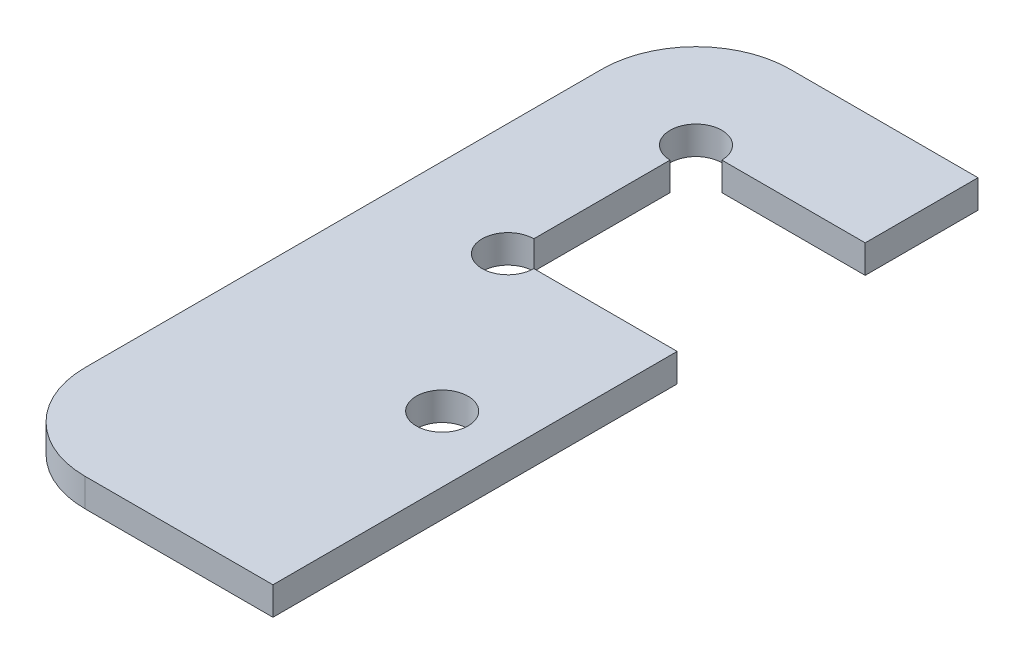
ISO-10303-21;
HEADER;
FILE_DESCRIPTION(('STEP AP214'),'2;1');
FILE_NAME('part.step','',(''),(''),'','','');
FILE_SCHEMA(('AUTOMOTIVE_DESIGN { 1 0 10303 214 1 1 1 1 }'));
ENDSEC;
DATA;
#1=APPLICATION_CONTEXT('core data for automotive mechanical design processes');
#2=APPLICATION_PROTOCOL_DEFINITION('international standard','automotive_design',2000,#1);
#3=PRODUCT_CONTEXT('',#1,'mechanical');
#4=PRODUCT('Part','Part','',(#3));
#5=PRODUCT_RELATED_PRODUCT_CATEGORY('part','',(#4));
#6=PRODUCT_DEFINITION_FORMATION('','',#4);
#7=PRODUCT_DEFINITION_CONTEXT('part definition',#1,'design');
#8=PRODUCT_DEFINITION('design','',#6,#7);
#9=PRODUCT_DEFINITION_SHAPE('','',#8);
#10=(LENGTH_UNIT() NAMED_UNIT(*) SI_UNIT(.MILLI.,.METRE.));
#11=(NAMED_UNIT(*) PLANE_ANGLE_UNIT() SI_UNIT($,.RADIAN.));
#12=(NAMED_UNIT(*) SI_UNIT($,.STERADIAN.) SOLID_ANGLE_UNIT());
#13=UNCERTAINTY_MEASURE_WITH_UNIT(LENGTH_MEASURE(1.E-05),#10,'distance_accuracy_value','');
#14=(GEOMETRIC_REPRESENTATION_CONTEXT(3) GLOBAL_UNCERTAINTY_ASSIGNED_CONTEXT((#13)) GLOBAL_UNIT_ASSIGNED_CONTEXT((#10,
#11,#12)) REPRESENTATION_CONTEXT('',''));
#15=CARTESIAN_POINT('',(0.,0.,0.));
#16=DIRECTION('',(0.,0.,1.));
#17=DIRECTION('',(1.,0.,0.));
#18=AXIS2_PLACEMENT_3D('',#15,#16,#17);
#19=CARTESIAN_POINT('',(10.,3.,-65.));
#20=DIRECTION('',(0.,-1.,0.));
#21=DIRECTION('',(0.,0.,-1.));
#22=AXIS2_PLACEMENT_3D('',#19,#20,#21);
#23=PLANE('',#22);
#24=DIRECTION('',(0.,0.,-1.));
#25=VECTOR('',#24,1.);
#26=CARTESIAN_POINT('',(30.,3.,-63.));
#27=LINE('',#26,#25);
#28=CARTESIAN_POINT('',(30.,3.,-63.));
#29=VERTEX_POINT('',#28);
#30=CARTESIAN_POINT('',(30.,3.,-75.));
#31=VERTEX_POINT('',#30);
#32=EDGE_CURVE('E164',#29,#31,#27,.T.);
#33=ORIENTED_EDGE('',*,*,#32,.T.);
#34=DIRECTION('',(-1.,0.,0.));
#35=VECTOR('',#34,1.);
#36=CARTESIAN_POINT('',(10.0000000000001,3.,-75.));
#37=LINE('',#36,#35);
#38=CARTESIAN_POINT('',(10.0000000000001,3.,-75.));
#39=VERTEX_POINT('',#38);
#40=EDGE_CURVE('E133',#31,#39,#37,.T.);
#41=ORIENTED_EDGE('',*,*,#40,.T.);
#42=CARTESIAN_POINT('',(10.,3.,-65.));
#43=DIRECTION('',(0.,1.,0.));
#44=DIRECTION('',(0.,0.,-1.));
#45=AXIS2_PLACEMENT_3D('',#42,#43,#44);
#46=CIRCLE('',#45,10.);
#47=CARTESIAN_POINT('',(0.,3.,-64.9999999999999));
#48=VERTEX_POINT('',#47);
#49=EDGE_CURVE('E167',#39,#48,#46,.T.);
#50=ORIENTED_EDGE('',*,*,#49,.T.);
#51=DIRECTION('',(0.,0.,1.));
#52=VECTOR('',#51,1.);
#53=CARTESIAN_POINT('',(0.,3.,-10.0000000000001));
#54=LINE('',#53,#52);
#55=CARTESIAN_POINT('',(0.,3.,-10.0000000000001));
#56=VERTEX_POINT('',#55);
#57=EDGE_CURVE('E169',#48,#56,#54,.T.);
#58=ORIENTED_EDGE('',*,*,#57,.T.);
#59=CARTESIAN_POINT('',(10.,3.,-10.));
#60=DIRECTION('',(0.,1.,0.));
#61=DIRECTION('',(0.,0.,-1.));
#62=AXIS2_PLACEMENT_3D('',#59,#60,#61);
#63=CIRCLE('',#62,10.);
#64=CARTESIAN_POINT('',(10.0000000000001,3.,0.));
#65=VERTEX_POINT('',#64);
#66=EDGE_CURVE('E171',#56,#65,#63,.T.);
#67=ORIENTED_EDGE('',*,*,#66,.T.);
#68=DIRECTION('',(1.,0.,0.));
#69=VECTOR('',#68,1.);
#70=CARTESIAN_POINT('',(10.0000000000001,3.,0.));
#71=LINE('',#70,#69);
#72=CARTESIAN_POINT('',(30.,3.,0.));
#73=VERTEX_POINT('',#72);
#74=EDGE_CURVE('E173',#65,#73,#71,.T.);
#75=ORIENTED_EDGE('',*,*,#74,.T.);
#76=DIRECTION('',(0.,0.,-1.));
#77=VECTOR('',#76,1.);
#78=CARTESIAN_POINT('',(30.,3.,0.));
#79=LINE('',#78,#77);
#80=CARTESIAN_POINT('',(30.,3.,-43.));
#81=VERTEX_POINT('',#80);
#82=EDGE_CURVE('E175',#73,#81,#79,.T.);
#83=ORIENTED_EDGE('',*,*,#82,.T.);
#84=DIRECTION('',(-1.,0.,0.));
#85=VECTOR('',#84,1.);
#86=CARTESIAN_POINT('',(14.75,3.,-43.));
#87=LINE('',#86,#85);
#88=CARTESIAN_POINT('',(14.75,3.,-43.));
#89=VERTEX_POINT('',#88);
#90=EDGE_CURVE('E177',#81,#89,#87,.T.);
#91=ORIENTED_EDGE('',*,*,#90,.T.);
#92=CARTESIAN_POINT('',(12.,3.,-43.));
#93=DIRECTION('',(0.,-1.,0.));
#94=DIRECTION('',(0.,0.,1.));
#95=AXIS2_PLACEMENT_3D('',#92,#93,#94);
#96=CIRCLE('',#95,2.75);
#97=CARTESIAN_POINT('',(12.,3.,-45.75));
#98=VERTEX_POINT('',#97);
#99=EDGE_CURVE('E179',#89,#98,#96,.T.);
#100=ORIENTED_EDGE('',*,*,#99,.T.);
#101=DIRECTION('',(0.,0.,-1.));
#102=VECTOR('',#101,1.);
#103=CARTESIAN_POINT('',(12.,3.,-45.75));
#104=LINE('',#103,#102);
#105=CARTESIAN_POINT('',(12.,3.,-60.25));
#106=VERTEX_POINT('',#105);
#107=EDGE_CURVE('E181',#98,#106,#104,.T.);
#108=ORIENTED_EDGE('',*,*,#107,.T.);
#109=CARTESIAN_POINT('',(12.,3.,-63.));
#110=DIRECTION('',(0.,-1.,0.));
#111=DIRECTION('',(0.,0.,1.));
#112=AXIS2_PLACEMENT_3D('',#109,#110,#111);
#113=CIRCLE('',#112,2.75);
#114=CARTESIAN_POINT('',(14.75,3.,-63.));
#115=VERTEX_POINT('',#114);
#116=EDGE_CURVE('E50',#106,#115,#113,.T.);
#117=ORIENTED_EDGE('',*,*,#116,.T.);
#118=DIRECTION('',(1.,0.,0.));
#119=VECTOR('',#118,1.);
#120=CARTESIAN_POINT('',(14.75,3.,-63.));
#121=LINE('',#120,#119);
#122=EDGE_CURVE('E45',#115,#29,#121,.T.);
#123=ORIENTED_EDGE('',*,*,#122,.T.);
#124=EDGE_LOOP('',(#33,#41,#50,#58,#67,#75,#83,#91,#100,#108,#117,#123));
#125=FACE_BOUND('',#124,.T.);
#126=CARTESIAN_POINT('',(23.,3.,-25.));
#127=DIRECTION('',(0.,1.,0.));
#128=DIRECTION('',(0.,0.,1.));
#129=AXIS2_PLACEMENT_3D('',#126,#127,#128);
#130=CIRCLE('',#129,2.75);
#131=CARTESIAN_POINT('',(23.,3.,-22.25));
#132=VERTEX_POINT('',#131);
#133=EDGE_CURVE('E138',#132,#132,#130,.T.);
#134=ORIENTED_EDGE('',*,*,#133,.F.);
#135=EDGE_LOOP('',(#134));
#136=FACE_BOUND('',#135,.T.);
#137=ADVANCED_FACE('F30',(#125,#136),#23,.F.);
#138=CARTESIAN_POINT('',(10.,0.,-65.));
#139=DIRECTION('',(0.,-1.,0.));
#140=DIRECTION('',(0.,0.,-1.));
#141=AXIS2_PLACEMENT_3D('',#138,#139,#140);
#142=PLANE('',#141);
#143=DIRECTION('',(0.,0.,-1.));
#144=VECTOR('',#143,1.);
#145=CARTESIAN_POINT('',(30.,0.,-63.));
#146=LINE('',#145,#144);
#147=CARTESIAN_POINT('',(30.,0.,-63.));
#148=VERTEX_POINT('',#147);
#149=CARTESIAN_POINT('',(30.,0.,-75.));
#150=VERTEX_POINT('',#149);
#151=EDGE_CURVE('E124',#148,#150,#146,.T.);
#152=ORIENTED_EDGE('',*,*,#151,.F.);
#153=DIRECTION('',(1.,0.,0.));
#154=VECTOR('',#153,1.);
#155=CARTESIAN_POINT('',(14.75,0.,-63.));
#156=LINE('',#155,#154);
#157=CARTESIAN_POINT('',(14.75,0.,-63.));
#158=VERTEX_POINT('',#157);
#159=EDGE_CURVE('E162',#158,#148,#156,.T.);
#160=ORIENTED_EDGE('',*,*,#159,.F.);
#161=CARTESIAN_POINT('',(12.,0.,-63.));
#162=DIRECTION('',(0.,-1.,0.));
#163=DIRECTION('',(0.,0.,1.));
#164=AXIS2_PLACEMENT_3D('',#161,#162,#163);
#165=CIRCLE('',#164,2.75);
#166=CARTESIAN_POINT('',(12.,0.,-60.25));
#167=VERTEX_POINT('',#166);
#168=EDGE_CURVE('E160',#167,#158,#165,.T.);
#169=ORIENTED_EDGE('',*,*,#168,.F.);
#170=DIRECTION('',(0.,0.,-1.));
#171=VECTOR('',#170,1.);
#172=CARTESIAN_POINT('',(12.,0.,-45.75));
#173=LINE('',#172,#171);
#174=CARTESIAN_POINT('',(12.,0.,-45.75));
#175=VERTEX_POINT('',#174);
#176=EDGE_CURVE('E158',#175,#167,#173,.T.);
#177=ORIENTED_EDGE('',*,*,#176,.F.);
#178=CARTESIAN_POINT('',(12.,0.,-43.));
#179=DIRECTION('',(0.,-1.,0.));
#180=DIRECTION('',(0.,0.,1.));
#181=AXIS2_PLACEMENT_3D('',#178,#179,#180);
#182=CIRCLE('',#181,2.75);
#183=CARTESIAN_POINT('',(14.75,0.,-43.));
#184=VERTEX_POINT('',#183);
#185=EDGE_CURVE('E156',#184,#175,#182,.T.);
#186=ORIENTED_EDGE('',*,*,#185,.F.);
#187=DIRECTION('',(-1.,0.,0.));
#188=VECTOR('',#187,1.);
#189=CARTESIAN_POINT('',(14.75,0.,-43.));
#190=LINE('',#189,#188);
#191=CARTESIAN_POINT('',(30.,0.,-43.));
#192=VERTEX_POINT('',#191);
#193=EDGE_CURVE('E154',#192,#184,#190,.T.);
#194=ORIENTED_EDGE('',*,*,#193,.F.);
#195=DIRECTION('',(0.,0.,-1.));
#196=VECTOR('',#195,1.);
#197=CARTESIAN_POINT('',(30.,0.,0.));
#198=LINE('',#197,#196);
#199=CARTESIAN_POINT('',(30.,0.,0.));
#200=VERTEX_POINT('',#199);
#201=EDGE_CURVE('E152',#200,#192,#198,.T.);
#202=ORIENTED_EDGE('',*,*,#201,.F.);
#203=DIRECTION('',(1.,0.,0.));
#204=VECTOR('',#203,1.);
#205=CARTESIAN_POINT('',(10.0000000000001,0.,0.));
#206=LINE('',#205,#204);
#207=CARTESIAN_POINT('',(10.0000000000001,0.,0.));
#208=VERTEX_POINT('',#207);
#209=EDGE_CURVE('E150',#208,#200,#206,.T.);
#210=ORIENTED_EDGE('',*,*,#209,.F.);
#211=CARTESIAN_POINT('',(10.,0.,-10.));
#212=DIRECTION('',(0.,1.,0.));
#213=DIRECTION('',(0.,0.,-1.));
#214=AXIS2_PLACEMENT_3D('',#211,#212,#213);
#215=CIRCLE('',#214,10.);
#216=CARTESIAN_POINT('',(0.,0.,-10.0000000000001));
#217=VERTEX_POINT('',#216);
#218=EDGE_CURVE('E148',#217,#208,#215,.T.);
#219=ORIENTED_EDGE('',*,*,#218,.F.);
#220=DIRECTION('',(0.,0.,1.));
#221=VECTOR('',#220,1.);
#222=CARTESIAN_POINT('',(0.,0.,-10.0000000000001));
#223=LINE('',#222,#221);
#224=CARTESIAN_POINT('',(0.,0.,-64.9999999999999));
#225=VERTEX_POINT('',#224);
#226=EDGE_CURVE('E146',#225,#217,#223,.T.);
#227=ORIENTED_EDGE('',*,*,#226,.F.);
#228=CARTESIAN_POINT('',(10.,0.,-65.));
#229=DIRECTION('',(0.,1.,0.));
#230=DIRECTION('',(0.,0.,-1.));
#231=AXIS2_PLACEMENT_3D('',#228,#229,#230);
#232=CIRCLE('',#231,10.);
#233=CARTESIAN_POINT('',(10.0000000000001,0.,-75.));
#234=VERTEX_POINT('',#233);
#235=EDGE_CURVE('E126',#234,#225,#232,.T.);
#236=ORIENTED_EDGE('',*,*,#235,.F.);
#237=DIRECTION('',(-1.,0.,0.));
#238=VECTOR('',#237,1.);
#239=CARTESIAN_POINT('',(10.0000000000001,0.,-75.));
#240=LINE('',#239,#238);
#241=EDGE_CURVE('E119',#150,#234,#240,.T.);
#242=ORIENTED_EDGE('',*,*,#241,.F.);
#243=EDGE_LOOP('',(#152,#160,#169,#177,#186,#194,#202,#210,#219,#227,#236,#242));
#244=FACE_BOUND('',#243,.T.);
#245=CARTESIAN_POINT('',(23.,0.,-25.));
#246=DIRECTION('',(0.,1.,0.));
#247=DIRECTION('',(0.,0.,1.));
#248=AXIS2_PLACEMENT_3D('',#245,#246,#247);
#249=CIRCLE('',#248,2.75);
#250=CARTESIAN_POINT('',(23.,0.,-22.25));
#251=VERTEX_POINT('',#250);
#252=EDGE_CURVE('E141',#251,#251,#249,.T.);
#253=ORIENTED_EDGE('',*,*,#252,.T.);
#254=EDGE_LOOP('',(#253));
#255=FACE_BOUND('',#254,.T.);
#256=ADVANCED_FACE('F120',(#244,#255),#142,.T.);
#257=CARTESIAN_POINT('',(30.,3.,-63.));
#258=DIRECTION('',(-1.,0.,0.));
#259=DIRECTION('',(0.,0.,1.));
#260=AXIS2_PLACEMENT_3D('',#257,#258,#259);
#261=PLANE('',#260);
#262=ORIENTED_EDGE('',*,*,#151,.T.);
#263=DIRECTION('',(0.,-1.,0.));
#264=VECTOR('',#263,1.);
#265=CARTESIAN_POINT('',(30.,3.,-75.));
#266=LINE('',#265,#264);
#267=EDGE_CURVE('E11',#31,#150,#266,.T.);
#268=ORIENTED_EDGE('',*,*,#267,.F.);
#269=ORIENTED_EDGE('',*,*,#32,.F.);
#270=DIRECTION('',(0.,-1.,0.));
#271=VECTOR('',#270,1.);
#272=CARTESIAN_POINT('',(30.,3.,-63.));
#273=LINE('',#272,#271);
#274=EDGE_CURVE('E137',#29,#148,#273,.T.);
#275=ORIENTED_EDGE('',*,*,#274,.T.);
#276=EDGE_LOOP('',(#262,#268,#269,#275));
#277=FACE_BOUND('',#276,.T.);
#278=ADVANCED_FACE('F32',(#277),#261,.F.);
#279=CARTESIAN_POINT('',(10.0000000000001,3.,-75.));
#280=DIRECTION('',(0.,0.,1.));
#281=DIRECTION('',(1.,0.,0.));
#282=AXIS2_PLACEMENT_3D('',#279,#280,#281);
#283=PLANE('',#282);
#284=ORIENTED_EDGE('',*,*,#241,.T.);
#285=DIRECTION('',(0.,-1.,0.));
#286=VECTOR('',#285,1.);
#287=CARTESIAN_POINT('',(10.0000000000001,3.,-75.));
#288=LINE('',#287,#286);
#289=EDGE_CURVE('E38',#39,#234,#288,.T.);
#290=ORIENTED_EDGE('',*,*,#289,.F.);
#291=ORIENTED_EDGE('',*,*,#40,.F.);
#292=ORIENTED_EDGE('',*,*,#267,.T.);
#293=EDGE_LOOP('',(#284,#290,#291,#292));
#294=FACE_BOUND('',#293,.T.);
#295=ADVANCED_FACE('F132',(#294),#283,.F.);
#296=CARTESIAN_POINT('',(10.,3.,-65.));
#297=DIRECTION('',(0.,-1.,0.));
#298=DIRECTION('',(0.,0.,-1.));
#299=AXIS2_PLACEMENT_3D('',#296,#297,#298);
#300=CYLINDRICAL_SURFACE('',#299,10.);
#301=ORIENTED_EDGE('',*,*,#235,.T.);
#302=DIRECTION('',(0.,-1.,0.));
#303=VECTOR('',#302,1.);
#304=CARTESIAN_POINT('',(0.,3.,-64.9999999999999));
#305=LINE('',#304,#303);
#306=EDGE_CURVE('E210',#48,#225,#305,.T.);
#307=ORIENTED_EDGE('',*,*,#306,.F.);
#308=ORIENTED_EDGE('',*,*,#49,.F.);
#309=ORIENTED_EDGE('',*,*,#289,.T.);
#310=EDGE_LOOP('',(#301,#307,#308,#309));
#311=FACE_BOUND('',#310,.T.);
#312=ADVANCED_FACE('F214',(#311),#300,.T.);
#313=CARTESIAN_POINT('',(0.,3.,-10.0000000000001));
#314=DIRECTION('',(1.,0.,0.));
#315=DIRECTION('',(0.,0.,-1.));
#316=AXIS2_PLACEMENT_3D('',#313,#314,#315);
#317=PLANE('',#316);
#318=ORIENTED_EDGE('',*,*,#226,.T.);
#319=DIRECTION('',(0.,-1.,0.));
#320=VECTOR('',#319,1.);
#321=CARTESIAN_POINT('',(0.,3.,-10.0000000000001));
#322=LINE('',#321,#320);
#323=EDGE_CURVE('E207',#56,#217,#322,.T.);
#324=ORIENTED_EDGE('',*,*,#323,.F.);
#325=ORIENTED_EDGE('',*,*,#57,.F.);
#326=ORIENTED_EDGE('',*,*,#306,.T.);
#327=EDGE_LOOP('',(#318,#324,#325,#326));
#328=FACE_BOUND('',#327,.T.);
#329=ADVANCED_FACE('F222',(#328),#317,.F.);
#330=CARTESIAN_POINT('',(10.,3.,-10.));
#331=DIRECTION('',(0.,-1.,0.));
#332=DIRECTION('',(0.,0.,-1.));
#333=AXIS2_PLACEMENT_3D('',#330,#331,#332);
#334=CYLINDRICAL_SURFACE('',#333,10.);
#335=ORIENTED_EDGE('',*,*,#218,.T.);
#336=DIRECTION('',(0.,-1.,0.));
#337=VECTOR('',#336,1.);
#338=CARTESIAN_POINT('',(10.0000000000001,3.,0.));
#339=LINE('',#338,#337);
#340=EDGE_CURVE('E204',#65,#208,#339,.T.);
#341=ORIENTED_EDGE('',*,*,#340,.F.);
#342=ORIENTED_EDGE('',*,*,#66,.F.);
#343=ORIENTED_EDGE('',*,*,#323,.T.);
#344=EDGE_LOOP('',(#335,#341,#342,#343));
#345=FACE_BOUND('',#344,.T.);
#346=ADVANCED_FACE('F225',(#345),#334,.T.);
#347=CARTESIAN_POINT('',(10.0000000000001,3.,0.));
#348=DIRECTION('',(0.,0.,-1.));
#349=DIRECTION('',(-1.,0.,0.));
#350=AXIS2_PLACEMENT_3D('',#347,#348,#349);
#351=PLANE('',#350);
#352=ORIENTED_EDGE('',*,*,#209,.T.);
#353=DIRECTION('',(0.,-1.,0.));
#354=VECTOR('',#353,1.);
#355=CARTESIAN_POINT('',(30.,3.,0.));
#356=LINE('',#355,#354);
#357=EDGE_CURVE('E201',#73,#200,#356,.T.);
#358=ORIENTED_EDGE('',*,*,#357,.F.);
#359=ORIENTED_EDGE('',*,*,#74,.F.);
#360=ORIENTED_EDGE('',*,*,#340,.T.);
#361=EDGE_LOOP('',(#352,#358,#359,#360));
#362=FACE_BOUND('',#361,.T.);
#363=ADVANCED_FACE('F230',(#362),#351,.F.);
#364=CARTESIAN_POINT('',(30.,3.,0.));
#365=DIRECTION('',(-1.,0.,0.));
#366=DIRECTION('',(0.,0.,1.));
#367=AXIS2_PLACEMENT_3D('',#364,#365,#366);
#368=PLANE('',#367);
#369=ORIENTED_EDGE('',*,*,#201,.T.);
#370=DIRECTION('',(0.,-1.,0.));
#371=VECTOR('',#370,1.);
#372=CARTESIAN_POINT('',(30.,3.,-43.));
#373=LINE('',#372,#371);
#374=EDGE_CURVE('E198',#81,#192,#373,.T.);
#375=ORIENTED_EDGE('',*,*,#374,.F.);
#376=ORIENTED_EDGE('',*,*,#82,.F.);
#377=ORIENTED_EDGE('',*,*,#357,.T.);
#378=EDGE_LOOP('',(#369,#375,#376,#377));
#379=FACE_BOUND('',#378,.T.);
#380=ADVANCED_FACE('F236',(#379),#368,.F.);
#381=CARTESIAN_POINT('',(14.75,3.,-43.));
#382=DIRECTION('',(0.,0.,1.));
#383=DIRECTION('',(1.,0.,0.));
#384=AXIS2_PLACEMENT_3D('',#381,#382,#383);
#385=PLANE('',#384);
#386=ORIENTED_EDGE('',*,*,#193,.T.);
#387=DIRECTION('',(0.,-1.,0.));
#388=VECTOR('',#387,1.);
#389=CARTESIAN_POINT('',(14.75,3.,-43.));
#390=LINE('',#389,#388);
#391=EDGE_CURVE('E195',#89,#184,#390,.T.);
#392=ORIENTED_EDGE('',*,*,#391,.F.);
#393=ORIENTED_EDGE('',*,*,#90,.F.);
#394=ORIENTED_EDGE('',*,*,#374,.T.);
#395=EDGE_LOOP('',(#386,#392,#393,#394));
#396=FACE_BOUND('',#395,.T.);
#397=ADVANCED_FACE('F240',(#396),#385,.F.);
#398=CARTESIAN_POINT('',(12.,3.,-43.));
#399=DIRECTION('',(0.,-1.,0.));
#400=DIRECTION('',(0.,0.,-1.));
#401=AXIS2_PLACEMENT_3D('',#398,#399,#400);
#402=CYLINDRICAL_SURFACE('',#401,2.75);
#403=ORIENTED_EDGE('',*,*,#185,.T.);
#404=DIRECTION('',(0.,-1.,0.));
#405=VECTOR('',#404,1.);
#406=CARTESIAN_POINT('',(12.,3.,-45.75));
#407=LINE('',#406,#405);
#408=EDGE_CURVE('E192',#98,#175,#407,.T.);
#409=ORIENTED_EDGE('',*,*,#408,.F.);
#410=ORIENTED_EDGE('',*,*,#99,.F.);
#411=ORIENTED_EDGE('',*,*,#391,.T.);
#412=EDGE_LOOP('',(#403,#409,#410,#411));
#413=FACE_BOUND('',#412,.T.);
#414=ADVANCED_FACE('F245',(#413),#402,.F.);
#415=CARTESIAN_POINT('',(12.,3.,-45.75));
#416=DIRECTION('',(-1.,0.,0.));
#417=DIRECTION('',(0.,0.,1.));
#418=AXIS2_PLACEMENT_3D('',#415,#416,#417);
#419=PLANE('',#418);
#420=ORIENTED_EDGE('',*,*,#176,.T.);
#421=DIRECTION('',(0.,-1.,0.));
#422=VECTOR('',#421,1.);
#423=CARTESIAN_POINT('',(12.,3.,-60.25));
#424=LINE('',#423,#422);
#425=EDGE_CURVE('E189',#106,#167,#424,.T.);
#426=ORIENTED_EDGE('',*,*,#425,.F.);
#427=ORIENTED_EDGE('',*,*,#107,.F.);
#428=ORIENTED_EDGE('',*,*,#408,.T.);
#429=EDGE_LOOP('',(#420,#426,#427,#428));
#430=FACE_BOUND('',#429,.T.);
#431=ADVANCED_FACE('F249',(#430),#419,.F.);
#432=CARTESIAN_POINT('',(12.,3.,-63.));
#433=DIRECTION('',(0.,-1.,0.));
#434=DIRECTION('',(0.,0.,-1.));
#435=AXIS2_PLACEMENT_3D('',#432,#433,#434);
#436=CYLINDRICAL_SURFACE('',#435,2.75);
#437=ORIENTED_EDGE('',*,*,#168,.T.);
#438=DIRECTION('',(0.,-1.,0.));
#439=VECTOR('',#438,1.);
#440=CARTESIAN_POINT('',(14.75,3.,-63.));
#441=LINE('',#440,#439);
#442=EDGE_CURVE('E186',#115,#158,#441,.T.);
#443=ORIENTED_EDGE('',*,*,#442,.F.);
#444=ORIENTED_EDGE('',*,*,#116,.F.);
#445=ORIENTED_EDGE('',*,*,#425,.T.);
#446=EDGE_LOOP('',(#437,#443,#444,#445));
#447=FACE_BOUND('',#446,.T.);
#448=ADVANCED_FACE('F253',(#447),#436,.F.);
#449=CARTESIAN_POINT('',(14.75,3.,-63.));
#450=DIRECTION('',(0.,0.,-1.));
#451=DIRECTION('',(-1.,0.,0.));
#452=AXIS2_PLACEMENT_3D('',#449,#450,#451);
#453=PLANE('',#452);
#454=ORIENTED_EDGE('',*,*,#159,.T.);
#455=ORIENTED_EDGE('',*,*,#274,.F.);
#456=ORIENTED_EDGE('',*,*,#122,.F.);
#457=ORIENTED_EDGE('',*,*,#442,.T.);
#458=EDGE_LOOP('',(#454,#455,#456,#457));
#459=FACE_BOUND('',#458,.T.);
#460=ADVANCED_FACE('F255',(#459),#453,.F.);
#461=CARTESIAN_POINT('',(23.,3.,-25.));
#462=DIRECTION('',(0.,-1.,0.));
#463=DIRECTION('',(0.,0.,-1.));
#464=AXIS2_PLACEMENT_3D('',#461,#462,#463);
#465=CYLINDRICAL_SURFACE('',#464,2.75);
#466=ORIENTED_EDGE('',*,*,#133,.T.);
#467=EDGE_LOOP('',(#466));
#468=FACE_BOUND('',#467,.T.);
#469=ORIENTED_EDGE('',*,*,#252,.F.);
#470=EDGE_LOOP('',(#469));
#471=FACE_BOUND('',#470,.T.);
#472=ADVANCED_FACE('F257',(#468,#471),#465,.F.);
#473=CLOSED_SHELL('',(#137,#256,#278,#295,#312,#329,#346,#363,#380,#397,#414,#431,#448,#460,#472));
#474=MANIFOLD_SOLID_BREP('B2',#473);
#475=ADVANCED_BREP_SHAPE_REPRESENTATION('',(#18,#474),#14);
#476=SHAPE_DEFINITION_REPRESENTATION(#9,#475);
ENDSEC;
END-ISO-10303-21;
